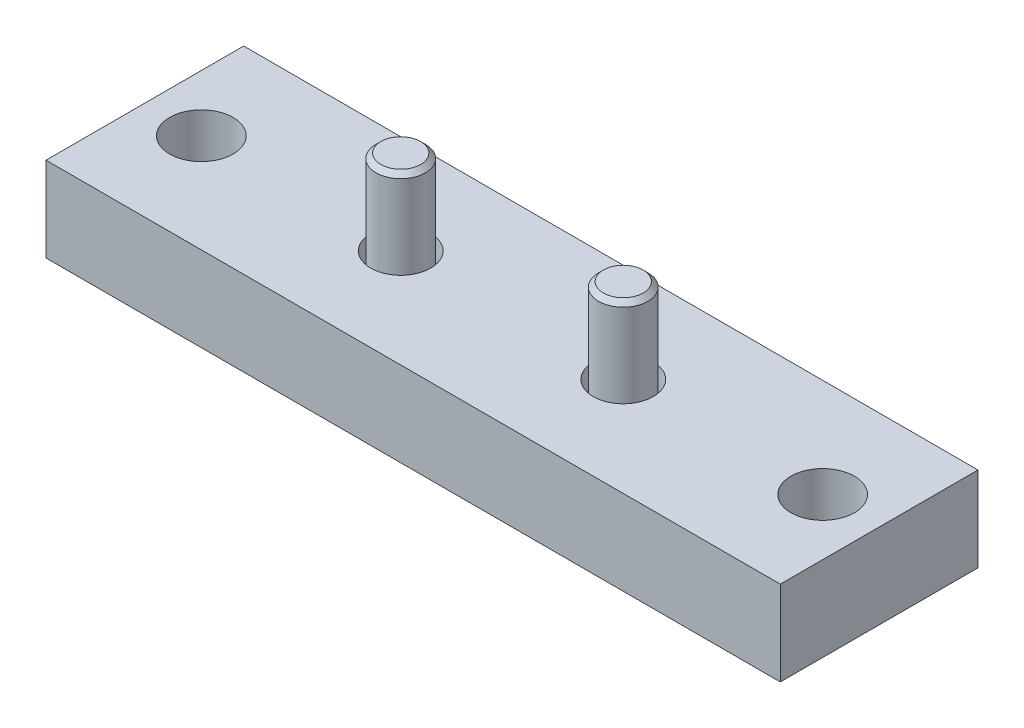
ISO-10303-21;
HEADER;
FILE_DESCRIPTION(('STEP AP214'),'2;1');
FILE_NAME('part.step','',(''),(''),'','','');
FILE_SCHEMA(('AUTOMOTIVE_DESIGN { 1 0 10303 214 1 1 1 1 }'));
ENDSEC;
DATA;
#1=APPLICATION_CONTEXT('core data for automotive mechanical design processes');
#2=APPLICATION_PROTOCOL_DEFINITION('international standard','automotive_design',2000,#1);
#3=PRODUCT_CONTEXT('',#1,'mechanical');
#4=PRODUCT('Part','Part','',(#3));
#5=PRODUCT_RELATED_PRODUCT_CATEGORY('part','',(#4));
#6=PRODUCT_DEFINITION_FORMATION('','',#4);
#7=PRODUCT_DEFINITION_CONTEXT('part definition',#1,'design');
#8=PRODUCT_DEFINITION('design','',#6,#7);
#9=PRODUCT_DEFINITION_SHAPE('','',#8);
#10=(LENGTH_UNIT() NAMED_UNIT(*) SI_UNIT(.MILLI.,.METRE.));
#11=(NAMED_UNIT(*) PLANE_ANGLE_UNIT() SI_UNIT($,.RADIAN.));
#12=(NAMED_UNIT(*) SI_UNIT($,.STERADIAN.) SOLID_ANGLE_UNIT());
#13=UNCERTAINTY_MEASURE_WITH_UNIT(LENGTH_MEASURE(1.E-05),#10,'distance_accuracy_value','');
#14=(GEOMETRIC_REPRESENTATION_CONTEXT(3) GLOBAL_UNCERTAINTY_ASSIGNED_CONTEXT((#13)) GLOBAL_UNIT_ASSIGNED_CONTEXT((#10,
#11,#12)) REPRESENTATION_CONTEXT('',''));
#15=CARTESIAN_POINT('',(0.,0.,0.));
#16=DIRECTION('',(0.,0.,1.));
#17=DIRECTION('',(1.,0.,0.));
#18=AXIS2_PLACEMENT_3D('',#15,#16,#17);
#19=CARTESIAN_POINT('',(25.019,-19.05,0.));
#20=DIRECTION('',(0.,-1.,0.));
#21=DIRECTION('',(0.,0.,1.));
#22=AXIS2_PLACEMENT_3D('',#19,#20,#21);
#23=PLANE('',#22);
#24=CARTESIAN_POINT('',(25.019,-19.05,0.));
#25=DIRECTION('',(0.,-1.,0.));
#26=DIRECTION('',(0.,0.,1.));
#27=AXIS2_PLACEMENT_3D('',#24,#25,#26);
#28=CIRCLE('',#27,10.7188);
#29=CARTESIAN_POINT('',(25.019,-19.05,10.7188));
#30=VERTEX_POINT('',#29);
#31=EDGE_CURVE('P0_E10',#30,#30,#28,.T.);
#32=ORIENTED_EDGE('',*,*,#31,.T.);
#33=EDGE_LOOP('',(#32));
#34=FACE_BOUND('',#33,.T.);
#35=DIRECTION('',(0.5,0.,-0.866025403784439));
#36=VECTOR('',#35,1.);
#37=CARTESIAN_POINT('',(26.8520871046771,-19.05,3.175));
#38=LINE('',#37,#36);
#39=CARTESIAN_POINT('',(26.8520871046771,-19.05,3.175));
#40=VERTEX_POINT('',#39);
#41=CARTESIAN_POINT('',(28.6851742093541,-19.05,0.));
#42=VERTEX_POINT('',#41);
#43=EDGE_CURVE('P0_E107',#40,#42,#38,.T.);
#44=ORIENTED_EDGE('',*,*,#43,.T.);
#45=DIRECTION('',(-0.5,0.,-0.866025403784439));
#46=VECTOR('',#45,1.);
#47=CARTESIAN_POINT('',(28.6851742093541,-19.05,0.));
#48=LINE('',#47,#46);
#49=CARTESIAN_POINT('',(26.8520871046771,-19.05,-3.175));
#50=VERTEX_POINT('',#49);
#51=EDGE_CURVE('P0_E29',#42,#50,#48,.T.);
#52=ORIENTED_EDGE('',*,*,#51,.T.);
#53=DIRECTION('',(-1.,0.,0.));
#54=VECTOR('',#53,1.);
#55=CARTESIAN_POINT('',(26.8520871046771,-19.05,-3.175));
#56=LINE('',#55,#54);
#57=CARTESIAN_POINT('',(23.185912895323,-19.05,-3.175));
#58=VERTEX_POINT('',#57);
#59=EDGE_CURVE('P0_E90',#50,#58,#56,.T.);
#60=ORIENTED_EDGE('',*,*,#59,.T.);
#61=DIRECTION('',(-0.5,0.,0.866025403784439));
#62=VECTOR('',#61,1.);
#63=CARTESIAN_POINT('',(23.185912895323,-19.05,-3.175));
#64=LINE('',#63,#62);
#65=CARTESIAN_POINT('',(21.3528257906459,-19.05,0.));
#66=VERTEX_POINT('',#65);
#67=EDGE_CURVE('P0_E97',#58,#66,#64,.T.);
#68=ORIENTED_EDGE('',*,*,#67,.T.);
#69=DIRECTION('',(0.5,0.,0.866025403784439));
#70=VECTOR('',#69,1.);
#71=CARTESIAN_POINT('',(21.3528257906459,-19.05,0.));
#72=LINE('',#71,#70);
#73=CARTESIAN_POINT('',(23.185912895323,-19.05,3.175));
#74=VERTEX_POINT('',#73);
#75=EDGE_CURVE('P0_E111',#66,#74,#72,.T.);
#76=ORIENTED_EDGE('',*,*,#75,.T.);
#77=DIRECTION('',(1.,0.,0.));
#78=VECTOR('',#77,1.);
#79=CARTESIAN_POINT('',(23.185912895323,-19.05,3.175));
#80=LINE('',#79,#78);
#81=EDGE_CURVE('P0_E114',#74,#40,#80,.T.);
#82=ORIENTED_EDGE('',*,*,#81,.T.);
#83=EDGE_LOOP('',(#44,#52,#60,#68,#76,#82));
#84=FACE_BOUND('',#83,.T.);
#85=ADVANCED_FACE('P0_F15',(#34,#84),#23,.T.);
#86=CARTESIAN_POINT('',(25.019,-19.05,0.));
#87=DIRECTION('',(0.,-1.,0.));
#88=DIRECTION('',(0.,0.,1.));
#89=AXIS2_PLACEMENT_3D('',#86,#87,#88);
#90=CYLINDRICAL_SURFACE('',#89,10.7188);
#91=CARTESIAN_POINT('',(25.019,-18.923,0.));
#92=DIRECTION('',(0.,-1.,0.));
#93=DIRECTION('',(0.,0.,1.));
#94=AXIS2_PLACEMENT_3D('',#91,#92,#93);
#95=CIRCLE('',#94,10.7188);
#96=CARTESIAN_POINT('',(25.019,-18.923,10.7188));
#97=VERTEX_POINT('',#96);
#98=EDGE_CURVE('P0_E22',#97,#97,#95,.T.);
#99=ORIENTED_EDGE('',*,*,#98,.T.);
#100=EDGE_LOOP('',(#99));
#101=FACE_BOUND('',#100,.T.);
#102=ORIENTED_EDGE('',*,*,#31,.F.);
#103=EDGE_LOOP('',(#102));
#104=FACE_BOUND('',#103,.T.);
#105=ADVANCED_FACE('P0_F164',(#101,#104),#90,.T.);
#106=CARTESIAN_POINT('',(25.019,-18.923,0.));
#107=DIRECTION('',(0.,-1.,0.));
#108=DIRECTION('',(0.,0.,1.));
#109=AXIS2_PLACEMENT_3D('',#106,#107,#108);
#110=CONICAL_SURFACE('',#109,10.7188,0.715584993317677);
#111=CARTESIAN_POINT('',(25.019,-12.9841655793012,0.));
#112=DIRECTION('',(0.,-1.,0.));
#113=DIRECTION('',(0.,0.,1.));
#114=AXIS2_PLACEMENT_3D('',#111,#112,#113);
#115=CIRCLE('',#114,5.55625);
#116=CARTESIAN_POINT('',(25.019,-12.9841655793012,5.55625));
#117=VERTEX_POINT('',#116);
#118=EDGE_CURVE('P0_E159',#117,#117,#115,.T.);
#119=ORIENTED_EDGE('',*,*,#118,.T.);
#120=EDGE_LOOP('',(#119));
#121=FACE_BOUND('',#120,.T.);
#122=ORIENTED_EDGE('',*,*,#98,.F.);
#123=EDGE_LOOP('',(#122));
#124=FACE_BOUND('',#123,.T.);
#125=ADVANCED_FACE('P0_F167',(#121,#124),#110,.T.);
#126=CARTESIAN_POINT('',(25.019,-19.05,0.));
#127=DIRECTION('',(0.,-1.,0.));
#128=DIRECTION('',(0.,0.,1.));
#129=AXIS2_PLACEMENT_3D('',#126,#127,#128);
#130=CYLINDRICAL_SURFACE('',#129,5.55625);
#131=CARTESIAN_POINT('',(25.019,17.9705,0.));
#132=DIRECTION('',(0.,-1.,0.));
#133=DIRECTION('',(0.,0.,1.));
#134=AXIS2_PLACEMENT_3D('',#131,#132,#133);
#135=CIRCLE('',#134,5.55625);
#136=CARTESIAN_POINT('',(25.019,17.9705,5.55625));
#137=VERTEX_POINT('',#136);
#138=EDGE_CURVE('P0_E156',#137,#137,#135,.T.);
#139=ORIENTED_EDGE('',*,*,#138,.T.);
#140=EDGE_LOOP('',(#139));
#141=FACE_BOUND('',#140,.T.);
#142=ORIENTED_EDGE('',*,*,#118,.F.);
#143=EDGE_LOOP('',(#142));
#144=FACE_BOUND('',#143,.T.);
#145=ADVANCED_FACE('P0_F169',(#141,#144),#130,.T.);
#146=CARTESIAN_POINT('',(25.019,19.05,0.));
#147=DIRECTION('',(0.,-1.,0.));
#148=DIRECTION('',(0.,0.,1.));
#149=AXIS2_PLACEMENT_3D('',#146,#147,#148);
#150=CONICAL_SURFACE('',#149,4.47675,0.785398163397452);
#151=ORIENTED_EDGE('',*,*,#138,.F.);
#152=EDGE_LOOP('',(#151));
#153=FACE_BOUND('',#152,.T.);
#154=CARTESIAN_POINT('',(25.019,19.05,0.));
#155=DIRECTION('',(0.,-1.,0.));
#156=DIRECTION('',(0.,0.,1.));
#157=AXIS2_PLACEMENT_3D('',#154,#155,#156);
#158=CIRCLE('',#157,4.47675);
#159=CARTESIAN_POINT('',(25.019,19.05,4.47675));
#160=VERTEX_POINT('',#159);
#161=EDGE_CURVE('P0_E152',#160,#160,#158,.T.);
#162=ORIENTED_EDGE('',*,*,#161,.T.);
#163=EDGE_LOOP('',(#162));
#164=FACE_BOUND('',#163,.T.);
#165=ADVANCED_FACE('P0_F177',(#153,#164),#150,.T.);
#166=CARTESIAN_POINT('',(20.54225,19.05,0.));
#167=DIRECTION('',(0.,1.,0.));
#168=DIRECTION('',(0.,0.,-1.));
#169=AXIS2_PLACEMENT_3D('',#166,#167,#168);
#170=PLANE('',#169);
#171=ORIENTED_EDGE('',*,*,#161,.F.);
#172=EDGE_LOOP('',(#171));
#173=FACE_BOUND('',#172,.T.);
#174=ADVANCED_FACE('P0_F216',(#173),#170,.T.);
#175=CARTESIAN_POINT('',(28.6851742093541,-15.0114,0.));
#176=DIRECTION('',(-0.866025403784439,0.,0.5));
#177=DIRECTION('',(0.5,0.,0.866025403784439));
#178=AXIS2_PLACEMENT_3D('',#175,#176,#177);
#179=PLANE('',#178);
#180=ORIENTED_EDGE('',*,*,#51,.F.);
#181=DIRECTION('',(0.,-1.,0.));
#182=VECTOR('',#181,1.);
#183=CARTESIAN_POINT('',(28.6851742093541,-15.0114,0.));
#184=LINE('',#183,#182);
#185=CARTESIAN_POINT('',(28.6851742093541,-15.0114,0.));
#186=VERTEX_POINT('',#185);
#187=EDGE_CURVE('P0_E137',#186,#42,#184,.T.);
#188=ORIENTED_EDGE('',*,*,#187,.F.);
#189=DIRECTION('',(-0.5,0.,-0.866025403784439));
#190=VECTOR('',#189,1.);
#191=CARTESIAN_POINT('',(28.6851742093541,-15.0114,0.));
#192=LINE('',#191,#190);
#193=CARTESIAN_POINT('',(27.7686306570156,-15.0114,-1.5875));
#194=VERTEX_POINT('',#193);
#195=EDGE_CURVE('P0_E117',#186,#194,#192,.T.);
#196=ORIENTED_EDGE('',*,*,#195,.T.);
#197=CARTESIAN_POINT('',(26.8520871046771,-15.0114,-3.175));
#198=VERTEX_POINT('',#197);
#199=EDGE_CURVE('P0_E102',#194,#198,#192,.T.);
#200=ORIENTED_EDGE('',*,*,#199,.T.);
#201=DIRECTION('',(0.,-1.,0.));
#202=VECTOR('',#201,1.);
#203=CARTESIAN_POINT('',(26.8520871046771,-15.0114,-3.175));
#204=LINE('',#203,#202);
#205=EDGE_CURVE('P0_E92',#198,#50,#204,.T.);
#206=ORIENTED_EDGE('',*,*,#205,.T.);
#207=EDGE_LOOP('',(#180,#188,#196,#200,#206));
#208=FACE_BOUND('',#207,.T.);
#209=ADVANCED_FACE('P0_F99',(#208),#179,.T.);
#210=CARTESIAN_POINT('',(26.8520871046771,-15.0114,-3.175));
#211=DIRECTION('',(0.,0.,1.));
#212=DIRECTION('',(0.,1.,0.));
#213=AXIS2_PLACEMENT_3D('',#210,#211,#212);
#214=PLANE('',#213);
#215=ORIENTED_EDGE('',*,*,#59,.F.);
#216=ORIENTED_EDGE('',*,*,#205,.F.);
#217=DIRECTION('',(-1.,0.,0.));
#218=VECTOR('',#217,1.);
#219=CARTESIAN_POINT('',(26.8520871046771,-15.0114,-3.175));
#220=LINE('',#219,#218);
#221=CARTESIAN_POINT('',(25.019,-15.0114,-3.175));
#222=VERTEX_POINT('',#221);
#223=EDGE_CURVE('P0_E37',#198,#222,#220,.T.);
#224=ORIENTED_EDGE('',*,*,#223,.T.);
#225=CARTESIAN_POINT('',(23.185912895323,-15.0114,-3.175));
#226=VERTEX_POINT('',#225);
#227=EDGE_CURVE('P0_E119',#222,#226,#220,.T.);
#228=ORIENTED_EDGE('',*,*,#227,.T.);
#229=DIRECTION('',(0.,-1.,0.));
#230=VECTOR('',#229,1.);
#231=CARTESIAN_POINT('',(23.185912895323,-15.0114,-3.175));
#232=LINE('',#231,#230);
#233=EDGE_CURVE('P0_E94',#226,#58,#232,.T.);
#234=ORIENTED_EDGE('',*,*,#233,.T.);
#235=EDGE_LOOP('',(#215,#216,#224,#228,#234));
#236=FACE_BOUND('',#235,.T.);
#237=ADVANCED_FACE('P0_F91',(#236),#214,.T.);
#238=CARTESIAN_POINT('',(23.185912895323,-15.0114,-3.175));
#239=DIRECTION('',(0.866025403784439,0.,0.5));
#240=DIRECTION('',(0.5,0.,-0.866025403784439));
#241=AXIS2_PLACEMENT_3D('',#238,#239,#240);
#242=PLANE('',#241);
#243=ORIENTED_EDGE('',*,*,#67,.F.);
#244=ORIENTED_EDGE('',*,*,#233,.F.);
#245=DIRECTION('',(-0.5,0.,0.866025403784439));
#246=VECTOR('',#245,1.);
#247=CARTESIAN_POINT('',(23.185912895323,-15.0114,-3.175));
#248=LINE('',#247,#246);
#249=CARTESIAN_POINT('',(22.2693693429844,-15.0114,-1.5875));
#250=VERTEX_POINT('',#249);
#251=EDGE_CURVE('P0_E122',#226,#250,#248,.T.);
#252=ORIENTED_EDGE('',*,*,#251,.T.);
#253=CARTESIAN_POINT('',(21.3528257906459,-15.0114,0.));
#254=VERTEX_POINT('',#253);
#255=EDGE_CURVE('P0_E121',#250,#254,#248,.T.);
#256=ORIENTED_EDGE('',*,*,#255,.T.);
#257=DIRECTION('',(0.,-1.,0.));
#258=VECTOR('',#257,1.);
#259=CARTESIAN_POINT('',(21.3528257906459,-15.0114,0.));
#260=LINE('',#259,#258);
#261=EDGE_CURVE('P0_E145',#254,#66,#260,.T.);
#262=ORIENTED_EDGE('',*,*,#261,.T.);
#263=EDGE_LOOP('',(#243,#244,#252,#256,#262));
#264=FACE_BOUND('',#263,.T.);
#265=ADVANCED_FACE('P0_F246',(#264),#242,.T.);
#266=CARTESIAN_POINT('',(21.3528257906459,-15.0114,0.));
#267=DIRECTION('',(0.866025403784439,0.,-0.5));
#268=DIRECTION('',(-0.5,0.,-0.866025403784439));
#269=AXIS2_PLACEMENT_3D('',#266,#267,#268);
#270=PLANE('',#269);
#271=ORIENTED_EDGE('',*,*,#75,.F.);
#272=ORIENTED_EDGE('',*,*,#261,.F.);
#273=DIRECTION('',(0.5,0.,0.866025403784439));
#274=VECTOR('',#273,1.);
#275=CARTESIAN_POINT('',(21.3528257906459,-15.0114,0.));
#276=LINE('',#275,#274);
#277=CARTESIAN_POINT('',(22.2693693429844,-15.0114,1.5875));
#278=VERTEX_POINT('',#277);
#279=EDGE_CURVE('P0_E126',#254,#278,#276,.T.);
#280=ORIENTED_EDGE('',*,*,#279,.T.);
#281=CARTESIAN_POINT('',(23.185912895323,-15.0114,3.175));
#282=VERTEX_POINT('',#281);
#283=EDGE_CURVE('P0_E125',#278,#282,#276,.T.);
#284=ORIENTED_EDGE('',*,*,#283,.T.);
#285=DIRECTION('',(0.,-1.,0.));
#286=VECTOR('',#285,1.);
#287=CARTESIAN_POINT('',(23.185912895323,-15.0114,3.175));
#288=LINE('',#287,#286);
#289=EDGE_CURVE('P0_E142',#282,#74,#288,.T.);
#290=ORIENTED_EDGE('',*,*,#289,.T.);
#291=EDGE_LOOP('',(#271,#272,#280,#284,#290));
#292=FACE_BOUND('',#291,.T.);
#293=ADVANCED_FACE('P0_F256',(#292),#270,.T.);
#294=CARTESIAN_POINT('',(23.185912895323,-15.0114,3.175));
#295=DIRECTION('',(0.,0.,-1.));
#296=DIRECTION('',(-1.,0.,0.));
#297=AXIS2_PLACEMENT_3D('',#294,#295,#296);
#298=PLANE('',#297);
#299=ORIENTED_EDGE('',*,*,#81,.F.);
#300=ORIENTED_EDGE('',*,*,#289,.F.);
#301=DIRECTION('',(1.,0.,0.));
#302=VECTOR('',#301,1.);
#303=CARTESIAN_POINT('',(23.185912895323,-15.0114,3.175));
#304=LINE('',#303,#302);
#305=CARTESIAN_POINT('',(25.019,-15.0114,3.175));
#306=VERTEX_POINT('',#305);
#307=EDGE_CURVE('P0_E130',#282,#306,#304,.T.);
#308=ORIENTED_EDGE('',*,*,#307,.T.);
#309=CARTESIAN_POINT('',(26.8520871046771,-15.0114,3.175));
#310=VERTEX_POINT('',#309);
#311=EDGE_CURVE('P0_E129',#306,#310,#304,.T.);
#312=ORIENTED_EDGE('',*,*,#311,.T.);
#313=DIRECTION('',(0.,-1.,0.));
#314=VECTOR('',#313,1.);
#315=CARTESIAN_POINT('',(26.8520871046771,-15.0114,3.175));
#316=LINE('',#315,#314);
#317=EDGE_CURVE('P0_E139',#310,#40,#316,.T.);
#318=ORIENTED_EDGE('',*,*,#317,.T.);
#319=EDGE_LOOP('',(#299,#300,#308,#312,#318));
#320=FACE_BOUND('',#319,.T.);
#321=ADVANCED_FACE('P0_F267',(#320),#298,.T.);
#322=CARTESIAN_POINT('',(26.8520871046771,-15.0114,3.175));
#323=DIRECTION('',(-0.866025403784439,0.,-0.5));
#324=DIRECTION('',(-0.5,0.,0.866025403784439));
#325=AXIS2_PLACEMENT_3D('',#322,#323,#324);
#326=PLANE('',#325);
#327=ORIENTED_EDGE('',*,*,#43,.F.);
#328=ORIENTED_EDGE('',*,*,#317,.F.);
#329=DIRECTION('',(0.5,0.,-0.866025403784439));
#330=VECTOR('',#329,1.);
#331=CARTESIAN_POINT('',(26.8520871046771,-15.0114,3.175));
#332=LINE('',#331,#330);
#333=CARTESIAN_POINT('',(27.7686306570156,-15.0114,1.5875));
#334=VERTEX_POINT('',#333);
#335=EDGE_CURVE('P0_E134',#310,#334,#332,.T.);
#336=ORIENTED_EDGE('',*,*,#335,.T.);
#337=EDGE_CURVE('P0_E133',#334,#186,#332,.T.);
#338=ORIENTED_EDGE('',*,*,#337,.T.);
#339=ORIENTED_EDGE('',*,*,#187,.T.);
#340=EDGE_LOOP('',(#327,#328,#336,#338,#339));
#341=FACE_BOUND('',#340,.T.);
#342=ADVANCED_FACE('P0_F278',(#341),#326,.T.);
#343=CARTESIAN_POINT('',(26.8520871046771,-15.0114,-3.175));
#344=DIRECTION('',(0.,1.,0.));
#345=DIRECTION('',(0.,0.,-1.));
#346=AXIS2_PLACEMENT_3D('',#343,#344,#345);
#347=PLANE('',#346);
#348=ORIENTED_EDGE('',*,*,#223,.F.);
#349=ORIENTED_EDGE('',*,*,#199,.F.);
#350=CARTESIAN_POINT('',(25.019,-15.0114,0.));
#351=DIRECTION('',(0.,-1.,0.));
#352=DIRECTION('',(0.,0.,1.));
#353=AXIS2_PLACEMENT_3D('',#350,#351,#352);
#354=CIRCLE('',#353,3.175);
#355=EDGE_CURVE('P0_E410',#222,#194,#354,.T.);
#356=ORIENTED_EDGE('',*,*,#355,.F.);
#357=EDGE_LOOP('',(#348,#349,#356));
#358=FACE_BOUND('',#357,.T.);
#359=ADVANCED_FACE('P0_F289',(#358),#347,.F.);
#360=ORIENTED_EDGE('',*,*,#195,.F.);
#361=ORIENTED_EDGE('',*,*,#337,.F.);
#362=EDGE_CURVE('P0_E412',#194,#334,#354,.T.);
#363=ORIENTED_EDGE('',*,*,#362,.F.);
#364=EDGE_LOOP('',(#360,#361,#363));
#365=FACE_BOUND('',#364,.T.);
#366=ADVANCED_FACE('P0_F300',(#365),#347,.F.);
#367=ORIENTED_EDGE('',*,*,#335,.F.);
#368=ORIENTED_EDGE('',*,*,#311,.F.);
#369=EDGE_CURVE('P0_E103',#334,#306,#354,.T.);
#370=ORIENTED_EDGE('',*,*,#369,.F.);
#371=EDGE_LOOP('',(#367,#368,#370));
#372=FACE_BOUND('',#371,.T.);
#373=ADVANCED_FACE('P0_F312',(#372),#347,.F.);
#374=ORIENTED_EDGE('',*,*,#307,.F.);
#375=ORIENTED_EDGE('',*,*,#283,.F.);
#376=EDGE_CURVE('P0_E149',#306,#278,#354,.T.);
#377=ORIENTED_EDGE('',*,*,#376,.F.);
#378=EDGE_LOOP('',(#374,#375,#377));
#379=FACE_BOUND('',#378,.T.);
#380=ADVANCED_FACE('P0_F322',(#379),#347,.F.);
#381=ORIENTED_EDGE('',*,*,#279,.F.);
#382=ORIENTED_EDGE('',*,*,#255,.F.);
#383=EDGE_CURVE('P0_E153',#278,#250,#354,.T.);
#384=ORIENTED_EDGE('',*,*,#383,.F.);
#385=EDGE_LOOP('',(#381,#382,#384));
#386=FACE_BOUND('',#385,.T.);
#387=ADVANCED_FACE('P0_F332',(#386),#347,.F.);
#388=ORIENTED_EDGE('',*,*,#251,.F.);
#389=ORIENTED_EDGE('',*,*,#227,.F.);
#390=EDGE_CURVE('P0_E409',#250,#222,#354,.T.);
#391=ORIENTED_EDGE('',*,*,#390,.F.);
#392=EDGE_LOOP('',(#388,#389,#391));
#393=FACE_BOUND('',#392,.T.);
#394=ADVANCED_FACE('P0_F303',(#393),#347,.F.);
#395=CARTESIAN_POINT('',(25.019,-15.0114,0.));
#396=DIRECTION('',(0.,-1.,0.));
#397=DIRECTION('',(0.,0.,1.));
#398=AXIS2_PLACEMENT_3D('',#395,#396,#397);
#399=CONICAL_SURFACE('',#398,3.175,1.0471975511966);
#400=CARTESIAN_POINT('',(25.019,-13.1783128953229,0.));
#401=VERTEX_POINT('',#400);
#402=VERTEX_LOOP('',#401);
#403=FACE_BOUND('',#402,.T.);
#404=ORIENTED_EDGE('',*,*,#376,.T.);
#405=ORIENTED_EDGE('',*,*,#383,.T.);
#406=ORIENTED_EDGE('',*,*,#390,.T.);
#407=ORIENTED_EDGE('',*,*,#355,.T.);
#408=ORIENTED_EDGE('',*,*,#362,.T.);
#409=ORIENTED_EDGE('',*,*,#369,.T.);
#410=EDGE_LOOP('',(#404,#405,#406,#407,#408,#409));
#411=FACE_BOUND('',#410,.T.);
#412=ADVANCED_FACE('P0_F351',(#403,#411),#399,.F.);
#413=CLOSED_SHELL('',(#85,#105,#125,#145,#165,#174,#209,#237,#265,#293,#321,#342,#359,#366,#373,
#380,#387,#394,#412));
#414=MANIFOLD_SOLID_BREP('P0_B1',#413);
#415=CARTESIAN_POINT('',(-25.019,-19.05,0.));
#416=DIRECTION('',(0.,-1.,0.));
#417=DIRECTION('',(0.,0.,1.));
#418=AXIS2_PLACEMENT_3D('',#415,#416,#417);
#419=PLANE('',#418);
#420=CARTESIAN_POINT('',(-25.019,-19.05,0.));
#421=DIRECTION('',(0.,-1.,0.));
#422=DIRECTION('',(0.,0.,1.));
#423=AXIS2_PLACEMENT_3D('',#420,#421,#422);
#424=CIRCLE('',#423,10.7188);
#425=CARTESIAN_POINT('',(-25.019,-19.05,10.7188));
#426=VERTEX_POINT('',#425);
#427=EDGE_CURVE('P1_E414',#426,#426,#424,.T.);
#428=ORIENTED_EDGE('',*,*,#427,.T.);
#429=EDGE_LOOP('',(#428));
#430=FACE_BOUND('',#429,.T.);
#431=DIRECTION('',(0.5,0.,-0.866025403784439));
#432=VECTOR('',#431,1.);
#433=CARTESIAN_POINT('',(-23.185912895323,-19.05,3.175));
#434=LINE('',#433,#432);
#435=CARTESIAN_POINT('',(-23.185912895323,-19.05,3.175));
#436=VERTEX_POINT('',#435);
#437=CARTESIAN_POINT('',(-21.3528257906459,-19.05,0.));
#438=VERTEX_POINT('',#437);
#439=EDGE_CURVE('P1_E102',#436,#438,#434,.T.);
#440=ORIENTED_EDGE('',*,*,#439,.T.);
#441=DIRECTION('',(-0.5,0.,-0.866025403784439));
#442=VECTOR('',#441,1.);
#443=CARTESIAN_POINT('',(-21.3528257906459,-19.05,0.));
#444=LINE('',#443,#442);
#445=CARTESIAN_POINT('',(-23.185912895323,-19.05,-3.175));
#446=VERTEX_POINT('',#445);
#447=EDGE_CURVE('P1_E11',#438,#446,#444,.T.);
#448=ORIENTED_EDGE('',*,*,#447,.T.);
#449=DIRECTION('',(-1.,0.,0.));
#450=VECTOR('',#449,1.);
#451=CARTESIAN_POINT('',(-23.185912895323,-19.05,-3.175));
#452=LINE('',#451,#450);
#453=CARTESIAN_POINT('',(-26.8520871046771,-19.05,-3.175));
#454=VERTEX_POINT('',#453);
#455=EDGE_CURVE('P1_E24',#446,#454,#452,.T.);
#456=ORIENTED_EDGE('',*,*,#455,.T.);
#457=DIRECTION('',(-0.5,0.,0.866025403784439));
#458=VECTOR('',#457,1.);
#459=CARTESIAN_POINT('',(-26.8520871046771,-19.05,-3.175));
#460=LINE('',#459,#458);
#461=CARTESIAN_POINT('',(-28.6851742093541,-19.05,0.));
#462=VERTEX_POINT('',#461);
#463=EDGE_CURVE('P1_E38',#454,#462,#460,.T.);
#464=ORIENTED_EDGE('',*,*,#463,.T.);
#465=DIRECTION('',(0.5,0.,0.866025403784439));
#466=VECTOR('',#465,1.);
#467=CARTESIAN_POINT('',(-28.6851742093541,-19.05,0.));
#468=LINE('',#467,#466);
#469=CARTESIAN_POINT('',(-26.8520871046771,-19.05,3.175));
#470=VERTEX_POINT('',#469);
#471=EDGE_CURVE('P1_E115',#462,#470,#468,.T.);
#472=ORIENTED_EDGE('',*,*,#471,.T.);
#473=DIRECTION('',(1.,0.,0.));
#474=VECTOR('',#473,1.);
#475=CARTESIAN_POINT('',(-26.8520871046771,-19.05,3.175));
#476=LINE('',#475,#474);
#477=EDGE_CURVE('P1_E112',#470,#436,#476,.T.);
#478=ORIENTED_EDGE('',*,*,#477,.T.);
#479=EDGE_LOOP('',(#440,#448,#456,#464,#472,#478));
#480=FACE_BOUND('',#479,.T.);
#481=ADVANCED_FACE('P1_F16',(#430,#480),#419,.T.);
#482=CARTESIAN_POINT('',(-25.019,-19.05,0.));
#483=DIRECTION('',(0.,-1.,0.));
#484=DIRECTION('',(0.,0.,1.));
#485=AXIS2_PLACEMENT_3D('',#482,#483,#484);
#486=CYLINDRICAL_SURFACE('',#485,10.7188);
#487=CARTESIAN_POINT('',(-25.019,-18.923,0.));
#488=DIRECTION('',(0.,-1.,0.));
#489=DIRECTION('',(0.,0.,1.));
#490=AXIS2_PLACEMENT_3D('',#487,#488,#489);
#491=CIRCLE('',#490,10.7188);
#492=CARTESIAN_POINT('',(-25.019,-18.923,10.7188));
#493=VERTEX_POINT('',#492);
#494=EDGE_CURVE('P1_E409',#493,#493,#491,.T.);
#495=ORIENTED_EDGE('',*,*,#494,.T.);
#496=EDGE_LOOP('',(#495));
#497=FACE_BOUND('',#496,.T.);
#498=ORIENTED_EDGE('',*,*,#427,.F.);
#499=EDGE_LOOP('',(#498));
#500=FACE_BOUND('',#499,.T.);
#501=ADVANCED_FACE('P1_F203',(#497,#500),#486,.T.);
#502=CARTESIAN_POINT('',(-25.019,-18.923,0.));
#503=DIRECTION('',(0.,-1.,0.));
#504=DIRECTION('',(0.,0.,1.));
#505=AXIS2_PLACEMENT_3D('',#502,#503,#504);
#506=CONICAL_SURFACE('',#505,10.7188,0.715584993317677);
#507=CARTESIAN_POINT('',(-25.019,-12.9841655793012,0.));
#508=DIRECTION('',(0.,-1.,0.));
#509=DIRECTION('',(0.,0.,1.));
#510=AXIS2_PLACEMENT_3D('',#507,#508,#509);
#511=CIRCLE('',#510,5.55625);
#512=CARTESIAN_POINT('',(-25.019,-12.9841655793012,5.55625));
#513=VERTEX_POINT('',#512);
#514=EDGE_CURVE('P1_E406',#513,#513,#511,.T.);
#515=ORIENTED_EDGE('',*,*,#514,.T.);
#516=EDGE_LOOP('',(#515));
#517=FACE_BOUND('',#516,.T.);
#518=ORIENTED_EDGE('',*,*,#494,.F.);
#519=EDGE_LOOP('',(#518));
#520=FACE_BOUND('',#519,.T.);
#521=ADVANCED_FACE('P1_F209',(#517,#520),#506,.T.);
#522=CARTESIAN_POINT('',(-25.019,-19.05,0.));
#523=DIRECTION('',(0.,-1.,0.));
#524=DIRECTION('',(0.,0.,1.));
#525=AXIS2_PLACEMENT_3D('',#522,#523,#524);
#526=CYLINDRICAL_SURFACE('',#525,5.55625);
#527=CARTESIAN_POINT('',(-25.019,17.9705,0.));
#528=DIRECTION('',(0.,-1.,0.));
#529=DIRECTION('',(0.,0.,1.));
#530=AXIS2_PLACEMENT_3D('',#527,#528,#529);
#531=CIRCLE('',#530,5.55625);
#532=CARTESIAN_POINT('',(-25.019,17.9705,5.55625));
#533=VERTEX_POINT('',#532);
#534=EDGE_CURVE('P1_E404',#533,#533,#531,.T.);
#535=ORIENTED_EDGE('',*,*,#534,.T.);
#536=EDGE_LOOP('',(#535));
#537=FACE_BOUND('',#536,.T.);
#538=ORIENTED_EDGE('',*,*,#514,.F.);
#539=EDGE_LOOP('',(#538));
#540=FACE_BOUND('',#539,.T.);
#541=ADVANCED_FACE('P1_F216',(#537,#540),#526,.T.);
#542=CARTESIAN_POINT('',(-25.019,19.05,0.));
#543=DIRECTION('',(0.,-1.,0.));
#544=DIRECTION('',(0.,0.,1.));
#545=AXIS2_PLACEMENT_3D('',#542,#543,#544);
#546=CONICAL_SURFACE('',#545,4.47675,0.785398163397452);
#547=ORIENTED_EDGE('',*,*,#534,.F.);
#548=EDGE_LOOP('',(#547));
#549=FACE_BOUND('',#548,.T.);
#550=CARTESIAN_POINT('',(-25.019,19.05,0.));
#551=DIRECTION('',(0.,-1.,0.));
#552=DIRECTION('',(0.,0.,1.));
#553=AXIS2_PLACEMENT_3D('',#550,#551,#552);
#554=CIRCLE('',#553,4.47675);
#555=CARTESIAN_POINT('',(-25.019,19.05,4.47675));
#556=VERTEX_POINT('',#555);
#557=EDGE_CURVE('P1_E175',#556,#556,#554,.T.);
#558=ORIENTED_EDGE('',*,*,#557,.T.);
#559=EDGE_LOOP('',(#558));
#560=FACE_BOUND('',#559,.T.);
#561=ADVANCED_FACE('P1_F220',(#549,#560),#546,.T.);
#562=CARTESIAN_POINT('',(-29.49575,19.05,0.));
#563=DIRECTION('',(0.,1.,0.));
#564=DIRECTION('',(0.,0.,-1.));
#565=AXIS2_PLACEMENT_3D('',#562,#563,#564);
#566=PLANE('',#565);
#567=ORIENTED_EDGE('',*,*,#557,.F.);
#568=EDGE_LOOP('',(#567));
#569=FACE_BOUND('',#568,.T.);
#570=ADVANCED_FACE('P1_F224',(#569),#566,.T.);
#571=CARTESIAN_POINT('',(-21.3528257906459,-15.0114,0.));
#572=DIRECTION('',(-0.866025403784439,0.,0.5));
#573=DIRECTION('',(0.5,0.,0.866025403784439));
#574=AXIS2_PLACEMENT_3D('',#571,#572,#573);
#575=PLANE('',#574);
#576=ORIENTED_EDGE('',*,*,#447,.F.);
#577=DIRECTION('',(0.,-1.,0.));
#578=VECTOR('',#577,1.);
#579=CARTESIAN_POINT('',(-21.3528257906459,-15.0114,0.));
#580=LINE('',#579,#578);
#581=CARTESIAN_POINT('',(-21.3528257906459,-15.0114,0.));
#582=VERTEX_POINT('',#581);
#583=EDGE_CURVE('P1_E94',#582,#438,#580,.T.);
#584=ORIENTED_EDGE('',*,*,#583,.F.);
#585=DIRECTION('',(-0.5,0.,-0.866025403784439));
#586=VECTOR('',#585,1.);
#587=CARTESIAN_POINT('',(-21.3528257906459,-15.0114,0.));
#588=LINE('',#587,#586);
#589=CARTESIAN_POINT('',(-22.2693693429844,-15.0114,-1.5875));
#590=VERTEX_POINT('',#589);
#591=EDGE_CURVE('P1_E117',#582,#590,#588,.T.);
#592=ORIENTED_EDGE('',*,*,#591,.T.);
#593=CARTESIAN_POINT('',(-23.185912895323,-15.0114,-3.175));
#594=VERTEX_POINT('',#593);
#595=EDGE_CURVE('P1_E113',#590,#594,#588,.T.);
#596=ORIENTED_EDGE('',*,*,#595,.T.);
#597=DIRECTION('',(0.,-1.,0.));
#598=VECTOR('',#597,1.);
#599=CARTESIAN_POINT('',(-23.185912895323,-15.0114,-3.175));
#600=LINE('',#599,#598);
#601=EDGE_CURVE('P1_E96',#594,#446,#600,.T.);
#602=ORIENTED_EDGE('',*,*,#601,.T.);
#603=EDGE_LOOP('',(#576,#584,#592,#596,#602));
#604=FACE_BOUND('',#603,.T.);
#605=ADVANCED_FACE('P1_F92',(#604),#575,.T.);
#606=CARTESIAN_POINT('',(-23.185912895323,-15.0114,-3.175));
#607=DIRECTION('',(0.,0.,1.));
#608=DIRECTION('',(0.,1.,0.));
#609=AXIS2_PLACEMENT_3D('',#606,#607,#608);
#610=PLANE('',#609);
#611=ORIENTED_EDGE('',*,*,#455,.F.);
#612=ORIENTED_EDGE('',*,*,#601,.F.);
#613=DIRECTION('',(-1.,0.,0.));
#614=VECTOR('',#613,1.);
#615=CARTESIAN_POINT('',(-23.185912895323,-15.0114,-3.175));
#616=LINE('',#615,#614);
#617=CARTESIAN_POINT('',(-25.019,-15.0114,-3.175));
#618=VERTEX_POINT('',#617);
#619=EDGE_CURVE('P1_E151',#594,#618,#616,.T.);
#620=ORIENTED_EDGE('',*,*,#619,.T.);
#621=CARTESIAN_POINT('',(-26.8520871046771,-15.0114,-3.175));
#622=VERTEX_POINT('',#621);
#623=EDGE_CURVE('P1_E152',#618,#622,#616,.T.);
#624=ORIENTED_EDGE('',*,*,#623,.T.);
#625=DIRECTION('',(0.,-1.,0.));
#626=VECTOR('',#625,1.);
#627=CARTESIAN_POINT('',(-26.8520871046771,-15.0114,-3.175));
#628=LINE('',#627,#626);
#629=EDGE_CURVE('P1_E135',#622,#454,#628,.T.);
#630=ORIENTED_EDGE('',*,*,#629,.T.);
#631=EDGE_LOOP('',(#611,#612,#620,#624,#630));
#632=FACE_BOUND('',#631,.T.);
#633=ADVANCED_FACE('P1_F231',(#632),#610,.T.);
#634=CARTESIAN_POINT('',(-26.8520871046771,-15.0114,-3.175));
#635=DIRECTION('',(0.866025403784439,0.,0.5));
#636=DIRECTION('',(0.5,0.,-0.866025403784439));
#637=AXIS2_PLACEMENT_3D('',#634,#635,#636);
#638=PLANE('',#637);
#639=ORIENTED_EDGE('',*,*,#463,.F.);
#640=ORIENTED_EDGE('',*,*,#629,.F.);
#641=DIRECTION('',(-0.5,0.,0.866025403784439));
#642=VECTOR('',#641,1.);
#643=CARTESIAN_POINT('',(-26.8520871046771,-15.0114,-3.175));
#644=LINE('',#643,#642);
#645=CARTESIAN_POINT('',(-27.7686306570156,-15.0114,-1.5875));
#646=VERTEX_POINT('',#645);
#647=EDGE_CURVE('P1_E150',#622,#646,#644,.T.);
#648=ORIENTED_EDGE('',*,*,#647,.T.);
#649=CARTESIAN_POINT('',(-28.6851742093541,-15.0114,0.));
#650=VERTEX_POINT('',#649);
#651=EDGE_CURVE('P1_E134',#646,#650,#644,.T.);
#652=ORIENTED_EDGE('',*,*,#651,.T.);
#653=DIRECTION('',(0.,-1.,0.));
#654=VECTOR('',#653,1.);
#655=CARTESIAN_POINT('',(-28.6851742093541,-15.0114,0.));
#656=LINE('',#655,#654);
#657=EDGE_CURVE('P1_E127',#650,#462,#656,.T.);
#658=ORIENTED_EDGE('',*,*,#657,.T.);
#659=EDGE_LOOP('',(#639,#640,#648,#652,#658));
#660=FACE_BOUND('',#659,.T.);
#661=ADVANCED_FACE('P1_F131',(#660),#638,.T.);
#662=CARTESIAN_POINT('',(-28.6851742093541,-15.0114,0.));
#663=DIRECTION('',(0.866025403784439,0.,-0.5));
#664=DIRECTION('',(-0.5,0.,-0.866025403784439));
#665=AXIS2_PLACEMENT_3D('',#662,#663,#664);
#666=PLANE('',#665);
#667=ORIENTED_EDGE('',*,*,#471,.F.);
#668=ORIENTED_EDGE('',*,*,#657,.F.);
#669=DIRECTION('',(0.5,0.,0.866025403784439));
#670=VECTOR('',#669,1.);
#671=CARTESIAN_POINT('',(-28.6851742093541,-15.0114,0.));
#672=LINE('',#671,#670);
#673=CARTESIAN_POINT('',(-27.7686306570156,-15.0114,1.5875));
#674=VERTEX_POINT('',#673);
#675=EDGE_CURVE('P1_E147',#650,#674,#672,.T.);
#676=ORIENTED_EDGE('',*,*,#675,.T.);
#677=CARTESIAN_POINT('',(-26.8520871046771,-15.0114,3.175));
#678=VERTEX_POINT('',#677);
#679=EDGE_CURVE('P1_E149',#674,#678,#672,.T.);
#680=ORIENTED_EDGE('',*,*,#679,.T.);
#681=DIRECTION('',(0.,-1.,0.));
#682=VECTOR('',#681,1.);
#683=CARTESIAN_POINT('',(-26.8520871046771,-15.0114,3.175));
#684=LINE('',#683,#682);
#685=EDGE_CURVE('P1_E130',#678,#470,#684,.T.);
#686=ORIENTED_EDGE('',*,*,#685,.T.);
#687=EDGE_LOOP('',(#667,#668,#676,#680,#686));
#688=FACE_BOUND('',#687,.T.);
#689=ADVANCED_FACE('P1_F125',(#688),#666,.T.);
#690=CARTESIAN_POINT('',(-26.8520871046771,-15.0114,3.175));
#691=DIRECTION('',(0.,0.,-1.));
#692=DIRECTION('',(-1.,0.,0.));
#693=AXIS2_PLACEMENT_3D('',#690,#691,#692);
#694=PLANE('',#693);
#695=ORIENTED_EDGE('',*,*,#477,.F.);
#696=ORIENTED_EDGE('',*,*,#685,.F.);
#697=DIRECTION('',(1.,0.,0.));
#698=VECTOR('',#697,1.);
#699=CARTESIAN_POINT('',(-26.8520871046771,-15.0114,3.175));
#700=LINE('',#699,#698);
#701=CARTESIAN_POINT('',(-25.019,-15.0114,3.175));
#702=VERTEX_POINT('',#701);
#703=EDGE_CURVE('P1_E143',#678,#702,#700,.T.);
#704=ORIENTED_EDGE('',*,*,#703,.T.);
#705=CARTESIAN_POINT('',(-23.185912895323,-15.0114,3.175));
#706=VERTEX_POINT('',#705);
#707=EDGE_CURVE('P1_E146',#702,#706,#700,.T.);
#708=ORIENTED_EDGE('',*,*,#707,.T.);
#709=DIRECTION('',(0.,-1.,0.));
#710=VECTOR('',#709,1.);
#711=CARTESIAN_POINT('',(-23.185912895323,-15.0114,3.175));
#712=LINE('',#711,#710);
#713=EDGE_CURVE('P1_E108',#706,#436,#712,.T.);
#714=ORIENTED_EDGE('',*,*,#713,.T.);
#715=EDGE_LOOP('',(#695,#696,#704,#708,#714));
#716=FACE_BOUND('',#715,.T.);
#717=ADVANCED_FACE('P1_F183',(#716),#694,.T.);
#718=CARTESIAN_POINT('',(-23.185912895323,-15.0114,3.175));
#719=DIRECTION('',(-0.866025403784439,0.,-0.5));
#720=DIRECTION('',(-0.5,0.,0.866025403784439));
#721=AXIS2_PLACEMENT_3D('',#718,#719,#720);
#722=PLANE('',#721);
#723=ORIENTED_EDGE('',*,*,#439,.F.);
#724=ORIENTED_EDGE('',*,*,#713,.F.);
#725=DIRECTION('',(0.5,0.,-0.866025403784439));
#726=VECTOR('',#725,1.);
#727=CARTESIAN_POINT('',(-23.185912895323,-15.0114,3.175));
#728=LINE('',#727,#726);
#729=CARTESIAN_POINT('',(-22.2693693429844,-15.0114,1.5875));
#730=VERTEX_POINT('',#729);
#731=EDGE_CURVE('P1_E107',#706,#730,#728,.T.);
#732=ORIENTED_EDGE('',*,*,#731,.T.);
#733=EDGE_CURVE('P1_E106',#730,#582,#728,.T.);
#734=ORIENTED_EDGE('',*,*,#733,.T.);
#735=ORIENTED_EDGE('',*,*,#583,.T.);
#736=EDGE_LOOP('',(#723,#724,#732,#734,#735));
#737=FACE_BOUND('',#736,.T.);
#738=ADVANCED_FACE('P1_F100',(#737),#722,.T.);
#739=CARTESIAN_POINT('',(-23.185912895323,-15.0114,-3.175));
#740=DIRECTION('',(0.,1.,0.));
#741=DIRECTION('',(0.,0.,-1.));
#742=AXIS2_PLACEMENT_3D('',#739,#740,#741);
#743=PLANE('',#742);
#744=ORIENTED_EDGE('',*,*,#619,.F.);
#745=ORIENTED_EDGE('',*,*,#595,.F.);
#746=CARTESIAN_POINT('',(-25.019,-15.0114,0.));
#747=DIRECTION('',(0.,-1.,0.));
#748=DIRECTION('',(0.,0.,1.));
#749=AXIS2_PLACEMENT_3D('',#746,#747,#748);
#750=CIRCLE('',#749,3.175);
#751=EDGE_CURVE('P1_E162',#618,#590,#750,.T.);
#752=ORIENTED_EDGE('',*,*,#751,.F.);
#753=EDGE_LOOP('',(#744,#745,#752));
#754=FACE_BOUND('',#753,.T.);
#755=ADVANCED_FACE('P1_F18',(#754),#743,.F.);
#756=ORIENTED_EDGE('',*,*,#591,.F.);
#757=ORIENTED_EDGE('',*,*,#733,.F.);
#758=EDGE_CURVE('P1_E166',#590,#730,#750,.T.);
#759=ORIENTED_EDGE('',*,*,#758,.F.);
#760=EDGE_LOOP('',(#756,#757,#759));
#761=FACE_BOUND('',#760,.T.);
#762=ADVANCED_FACE('P1_F181',(#761),#743,.F.);
#763=ORIENTED_EDGE('',*,*,#731,.F.);
#764=ORIENTED_EDGE('',*,*,#707,.F.);
#765=EDGE_CURVE('P1_E171',#730,#702,#750,.T.);
#766=ORIENTED_EDGE('',*,*,#765,.F.);
#767=EDGE_LOOP('',(#763,#764,#766));
#768=FACE_BOUND('',#767,.T.);
#769=ADVANCED_FACE('P1_F180',(#768),#743,.F.);
#770=ORIENTED_EDGE('',*,*,#703,.F.);
#771=ORIENTED_EDGE('',*,*,#679,.F.);
#772=EDGE_CURVE('P1_E173',#702,#674,#750,.T.);
#773=ORIENTED_EDGE('',*,*,#772,.F.);
#774=EDGE_LOOP('',(#770,#771,#773));
#775=FACE_BOUND('',#774,.T.);
#776=ADVANCED_FACE('P1_F187',(#775),#743,.F.);
#777=ORIENTED_EDGE('',*,*,#675,.F.);
#778=ORIENTED_EDGE('',*,*,#651,.F.);
#779=EDGE_CURVE('P1_E172',#674,#646,#750,.T.);
#780=ORIENTED_EDGE('',*,*,#779,.F.);
#781=EDGE_LOOP('',(#777,#778,#780));
#782=FACE_BOUND('',#781,.T.);
#783=ADVANCED_FACE('P1_F189',(#782),#743,.F.);
#784=ORIENTED_EDGE('',*,*,#647,.F.);
#785=ORIENTED_EDGE('',*,*,#623,.F.);
#786=EDGE_CURVE('P1_E168',#646,#618,#750,.T.);
#787=ORIENTED_EDGE('',*,*,#786,.F.);
#788=EDGE_LOOP('',(#784,#785,#787));
#789=FACE_BOUND('',#788,.T.);
#790=ADVANCED_FACE('P1_F192',(#789),#743,.F.);
#791=CARTESIAN_POINT('',(-25.019,-15.0114,0.));
#792=DIRECTION('',(0.,-1.,0.));
#793=DIRECTION('',(0.,0.,1.));
#794=AXIS2_PLACEMENT_3D('',#791,#792,#793);
#795=CONICAL_SURFACE('',#794,3.175,1.0471975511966);
#796=CARTESIAN_POINT('',(-25.019,-13.1783128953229,0.));
#797=VERTEX_POINT('',#796);
#798=VERTEX_LOOP('',#797);
#799=FACE_BOUND('',#798,.T.);
#800=ORIENTED_EDGE('',*,*,#772,.T.);
#801=ORIENTED_EDGE('',*,*,#779,.T.);
#802=ORIENTED_EDGE('',*,*,#786,.T.);
#803=ORIENTED_EDGE('',*,*,#751,.T.);
#804=ORIENTED_EDGE('',*,*,#758,.T.);
#805=ORIENTED_EDGE('',*,*,#765,.T.);
#806=EDGE_LOOP('',(#800,#801,#802,#803,#804,#805));
#807=FACE_BOUND('',#806,.T.);
#808=ADVANCED_FACE('P1_F164',(#799,#807),#795,.F.);
#809=CLOSED_SHELL('',(#481,#501,#521,#541,#561,#570,#605,#633,#661,#689,#717,#738,#755,#762,
#769,#776,#783,#790,#808));
#810=MANIFOLD_SOLID_BREP('P1_B1',#809);
#811=CARTESIAN_POINT('',(82.55,-19.05,-22.225));
#812=DIRECTION('',(-1.,0.,0.));
#813=DIRECTION('',(0.,0.,-1.));
#814=AXIS2_PLACEMENT_3D('',#811,#812,#813);
#815=PLANE('',#814);
#816=DIRECTION('',(0.,0.,1.));
#817=VECTOR('',#816,1.);
#818=CARTESIAN_POINT('',(82.55,0.,-22.225));
#819=LINE('',#818,#817);
#820=CARTESIAN_POINT('',(82.55,0.,-22.225));
#821=VERTEX_POINT('',#820);
#822=CARTESIAN_POINT('',(82.55,0.,22.225));
#823=VERTEX_POINT('',#822);
#824=EDGE_CURVE('P2_E87',#821,#823,#819,.T.);
#825=ORIENTED_EDGE('',*,*,#824,.T.);
#826=DIRECTION('',(0.,1.,0.));
#827=VECTOR('',#826,1.);
#828=CARTESIAN_POINT('',(82.55,-19.05,22.225));
#829=LINE('',#828,#827);
#830=CARTESIAN_POINT('',(82.55,-19.05,22.225));
#831=VERTEX_POINT('',#830);
#832=EDGE_CURVE('P2_E77',#831,#823,#829,.T.);
#833=ORIENTED_EDGE('',*,*,#832,.F.);
#834=DIRECTION('',(0.,0.,1.));
#835=VECTOR('',#834,1.);
#836=CARTESIAN_POINT('',(82.55,-19.05,-22.225));
#837=LINE('',#836,#835);
#838=CARTESIAN_POINT('',(82.55,-19.05,-22.225));
#839=VERTEX_POINT('',#838);
#840=EDGE_CURVE('P2_E60',#839,#831,#837,.T.);
#841=ORIENTED_EDGE('',*,*,#840,.F.);
#842=DIRECTION('',(0.,1.,0.));
#843=VECTOR('',#842,1.);
#844=CARTESIAN_POINT('',(82.55,-19.05,-22.225));
#845=LINE('',#844,#843);
#846=EDGE_CURVE('P2_E67',#839,#821,#845,.T.);
#847=ORIENTED_EDGE('',*,*,#846,.T.);
#848=EDGE_LOOP('',(#825,#833,#841,#847));
#849=FACE_BOUND('',#848,.T.);
#850=ADVANCED_FACE('P2_F15',(#849),#815,.F.);
#851=CARTESIAN_POINT('',(82.55,-19.05,22.225));
#852=DIRECTION('',(0.,0.,-1.));
#853=DIRECTION('',(1.,0.,0.));
#854=AXIS2_PLACEMENT_3D('',#851,#852,#853);
#855=PLANE('',#854);
#856=DIRECTION('',(-1.,0.,0.));
#857=VECTOR('',#856,1.);
#858=CARTESIAN_POINT('',(82.55,0.,22.225));
#859=LINE('',#858,#857);
#860=CARTESIAN_POINT('',(-82.55,0.,22.225));
#861=VERTEX_POINT('',#860);
#862=EDGE_CURVE('P2_E30',#823,#861,#859,.T.);
#863=ORIENTED_EDGE('',*,*,#862,.T.);
#864=DIRECTION('',(0.,1.,0.));
#865=VECTOR('',#864,1.);
#866=CARTESIAN_POINT('',(-82.55,-19.05,22.225));
#867=LINE('',#866,#865);
#868=CARTESIAN_POINT('',(-82.55,-19.05,22.225));
#869=VERTEX_POINT('',#868);
#870=EDGE_CURVE('P2_E277',#869,#861,#867,.T.);
#871=ORIENTED_EDGE('',*,*,#870,.F.);
#872=DIRECTION('',(-1.,0.,0.));
#873=VECTOR('',#872,1.);
#874=CARTESIAN_POINT('',(82.55,-19.05,22.225));
#875=LINE('',#874,#873);
#876=EDGE_CURVE('P2_E78',#831,#869,#875,.T.);
#877=ORIENTED_EDGE('',*,*,#876,.F.);
#878=ORIENTED_EDGE('',*,*,#832,.T.);
#879=EDGE_LOOP('',(#863,#871,#877,#878));
#880=FACE_BOUND('',#879,.T.);
#881=ADVANCED_FACE('P2_F148',(#880),#855,.F.);
#882=CARTESIAN_POINT('',(-82.55,-19.05,-22.225));
#883=DIRECTION('',(1.,0.,0.));
#884=DIRECTION('',(0.,0.,1.));
#885=AXIS2_PLACEMENT_3D('',#882,#883,#884);
#886=PLANE('',#885);
#887=DIRECTION('',(0.,0.,-1.));
#888=VECTOR('',#887,1.);
#889=CARTESIAN_POINT('',(-82.55,0.,-22.225));
#890=LINE('',#889,#888);
#891=CARTESIAN_POINT('',(-82.55,0.,-22.225));
#892=VERTEX_POINT('',#891);
#893=EDGE_CURVE('P2_E80',#861,#892,#890,.T.);
#894=ORIENTED_EDGE('',*,*,#893,.T.);
#895=DIRECTION('',(0.,1.,0.));
#896=VECTOR('',#895,1.);
#897=CARTESIAN_POINT('',(-82.55,-19.05,-22.225));
#898=LINE('',#897,#896);
#899=CARTESIAN_POINT('',(-82.55,-19.05,-22.225));
#900=VERTEX_POINT('',#899);
#901=EDGE_CURVE('P2_E75',#900,#892,#898,.T.);
#902=ORIENTED_EDGE('',*,*,#901,.F.);
#903=DIRECTION('',(0.,0.,-1.));
#904=VECTOR('',#903,1.);
#905=CARTESIAN_POINT('',(-82.55,-19.05,-22.225));
#906=LINE('',#905,#904);
#907=EDGE_CURVE('P2_E63',#869,#900,#906,.T.);
#908=ORIENTED_EDGE('',*,*,#907,.F.);
#909=ORIENTED_EDGE('',*,*,#870,.T.);
#910=EDGE_LOOP('',(#894,#902,#908,#909));
#911=FACE_BOUND('',#910,.T.);
#912=ADVANCED_FACE('P2_F153',(#911),#886,.F.);
#913=CARTESIAN_POINT('',(82.55,-19.05,-22.225));
#914=DIRECTION('',(0.,0.,1.));
#915=DIRECTION('',(-1.,0.,0.));
#916=AXIS2_PLACEMENT_3D('',#913,#914,#915);
#917=PLANE('',#916);
#918=DIRECTION('',(1.,0.,0.));
#919=VECTOR('',#918,1.);
#920=CARTESIAN_POINT('',(82.55,0.,-22.225));
#921=LINE('',#920,#919);
#922=EDGE_CURVE('P2_E72',#892,#821,#921,.T.);
#923=ORIENTED_EDGE('',*,*,#922,.T.);
#924=ORIENTED_EDGE('',*,*,#846,.F.);
#925=DIRECTION('',(1.,0.,0.));
#926=VECTOR('',#925,1.);
#927=CARTESIAN_POINT('',(82.55,-19.05,-22.225));
#928=LINE('',#927,#926);
#929=EDGE_CURVE('P2_E56',#900,#839,#928,.T.);
#930=ORIENTED_EDGE('',*,*,#929,.F.);
#931=ORIENTED_EDGE('',*,*,#901,.T.);
#932=EDGE_LOOP('',(#923,#924,#930,#931));
#933=FACE_BOUND('',#932,.T.);
#934=ADVANCED_FACE('P2_F70',(#933),#917,.F.);
#935=CARTESIAN_POINT('',(82.55,-19.05,-22.225));
#936=DIRECTION('',(0.,-1.,0.));
#937=DIRECTION('',(0.,0.,1.));
#938=AXIS2_PLACEMENT_3D('',#935,#936,#937);
#939=PLANE('',#938);
#940=CARTESIAN_POINT('',(69.85,-19.05,0.));
#941=DIRECTION('',(0.,-1.,0.));
#942=DIRECTION('',(0.,0.,1.));
#943=AXIS2_PLACEMENT_3D('',#940,#941,#942);
#944=CIRCLE('',#943,7.1374);
#945=CARTESIAN_POINT('',(69.85,-19.05,7.1374));
#946=VERTEX_POINT('',#945);
#947=EDGE_CURVE('P2_E10',#946,#946,#944,.T.);
#948=ORIENTED_EDGE('',*,*,#947,.F.);
#949=EDGE_LOOP('',(#948));
#950=FACE_BOUND('',#949,.T.);
#951=CARTESIAN_POINT('',(-69.85,-19.05,0.));
#952=DIRECTION('',(0.,-1.,0.));
#953=DIRECTION('',(0.,0.,1.));
#954=AXIS2_PLACEMENT_3D('',#951,#952,#953);
#955=CIRCLE('',#954,7.1374);
#956=CARTESIAN_POINT('',(-69.85,-19.05,7.1374));
#957=VERTEX_POINT('',#956);
#958=EDGE_CURVE('P2_E110',#957,#957,#955,.T.);
#959=ORIENTED_EDGE('',*,*,#958,.F.);
#960=EDGE_LOOP('',(#959));
#961=FACE_BOUND('',#960,.T.);
#962=CARTESIAN_POINT('',(25.019,-19.05,0.));
#963=DIRECTION('',(0.,-1.,0.));
#964=DIRECTION('',(0.,0.,1.));
#965=AXIS2_PLACEMENT_3D('',#962,#963,#964);
#966=CIRCLE('',#965,11.9126);
#967=CARTESIAN_POINT('',(25.019,-19.05,11.9126));
#968=VERTEX_POINT('',#967);
#969=EDGE_CURVE('P2_E101',#968,#968,#966,.T.);
#970=ORIENTED_EDGE('',*,*,#969,.F.);
#971=EDGE_LOOP('',(#970));
#972=FACE_BOUND('',#971,.T.);
#973=CARTESIAN_POINT('',(-25.019,-19.05,0.));
#974=DIRECTION('',(0.,-1.,0.));
#975=DIRECTION('',(0.,0.,1.));
#976=AXIS2_PLACEMENT_3D('',#973,#974,#975);
#977=CIRCLE('',#976,11.9126);
#978=CARTESIAN_POINT('',(-25.019,-19.05,11.9126));
#979=VERTEX_POINT('',#978);
#980=EDGE_CURVE('P2_E92',#979,#979,#977,.T.);
#981=ORIENTED_EDGE('',*,*,#980,.F.);
#982=EDGE_LOOP('',(#981));
#983=FACE_BOUND('',#982,.T.);
#984=ORIENTED_EDGE('',*,*,#840,.T.);
#985=ORIENTED_EDGE('',*,*,#876,.T.);
#986=ORIENTED_EDGE('',*,*,#907,.T.);
#987=ORIENTED_EDGE('',*,*,#929,.T.);
#988=EDGE_LOOP('',(#984,#985,#986,#987));
#989=FACE_BOUND('',#988,.T.);
#990=ADVANCED_FACE('P2_F58',(#950,#961,#972,#983,#989),#939,.T.);
#991=CARTESIAN_POINT('',(82.55,0.,-22.225));
#992=DIRECTION('',(0.,-1.,0.));
#993=DIRECTION('',(0.,0.,1.));
#994=AXIS2_PLACEMENT_3D('',#991,#992,#993);
#995=PLANE('',#994);
#996=CARTESIAN_POINT('',(69.85,0.,0.));
#997=DIRECTION('',(0.,-1.,0.));
#998=DIRECTION('',(0.,0.,1.));
#999=AXIS2_PLACEMENT_3D('',#996,#997,#998);
#1000=CIRCLE('',#999,7.1374);
#1001=CARTESIAN_POINT('',(69.85,0.,7.1374));
#1002=VERTEX_POINT('',#1001);
#1003=EDGE_CURVE('P2_E23',#1002,#1002,#1000,.T.);
#1004=ORIENTED_EDGE('',*,*,#1003,.T.);
#1005=EDGE_LOOP('',(#1004));
#1006=FACE_BOUND('',#1005,.T.);
#1007=CARTESIAN_POINT('',(-69.85,0.,0.));
#1008=DIRECTION('',(0.,-1.,0.));
#1009=DIRECTION('',(0.,0.,1.));
#1010=AXIS2_PLACEMENT_3D('',#1007,#1008,#1009);
#1011=CIRCLE('',#1010,7.1374);
#1012=CARTESIAN_POINT('',(-69.85,0.,7.1374));
#1013=VERTEX_POINT('',#1012);
#1014=EDGE_CURVE('P2_E107',#1013,#1013,#1011,.T.);
#1015=ORIENTED_EDGE('',*,*,#1014,.T.);
#1016=EDGE_LOOP('',(#1015));
#1017=FACE_BOUND('',#1016,.T.);
#1018=CARTESIAN_POINT('',(25.019,0.,0.));
#1019=DIRECTION('',(0.,-1.,0.));
#1020=DIRECTION('',(0.,0.,1.));
#1021=AXIS2_PLACEMENT_3D('',#1018,#1019,#1020);
#1022=CIRCLE('',#1021,6.7437);
#1023=CARTESIAN_POINT('',(25.019,0.,6.7437));
#1024=VERTEX_POINT('',#1023);
#1025=EDGE_CURVE('P2_E98',#1024,#1024,#1022,.T.);
#1026=ORIENTED_EDGE('',*,*,#1025,.T.);
#1027=EDGE_LOOP('',(#1026));
#1028=FACE_BOUND('',#1027,.T.);
#1029=CARTESIAN_POINT('',(-25.019,0.,0.));
#1030=DIRECTION('',(0.,-1.,0.));
#1031=DIRECTION('',(0.,0.,1.));
#1032=AXIS2_PLACEMENT_3D('',#1029,#1030,#1031);
#1033=CIRCLE('',#1032,6.7437);
#1034=CARTESIAN_POINT('',(-25.019,0.,6.7437));
#1035=VERTEX_POINT('',#1034);
#1036=EDGE_CURVE('P2_E89',#1035,#1035,#1033,.T.);
#1037=ORIENTED_EDGE('',*,*,#1036,.T.);
#1038=EDGE_LOOP('',(#1037));
#1039=FACE_BOUND('',#1038,.T.);
#1040=ORIENTED_EDGE('',*,*,#824,.F.);
#1041=ORIENTED_EDGE('',*,*,#922,.F.);
#1042=ORIENTED_EDGE('',*,*,#893,.F.);
#1043=ORIENTED_EDGE('',*,*,#862,.F.);
#1044=EDGE_LOOP('',(#1040,#1041,#1042,#1043));
#1045=FACE_BOUND('',#1044,.T.);
#1046=ADVANCED_FACE('P2_F115',(#1006,#1017,#1028,#1039,#1045),#995,.F.);
#1047=CARTESIAN_POINT('',(-25.019,-19.05,0.));
#1048=DIRECTION('',(0.,-1.,0.));
#1049=DIRECTION('',(0.,0.,1.));
#1050=AXIS2_PLACEMENT_3D('',#1047,#1048,#1049);
#1051=CONICAL_SURFACE('',#1050,11.9126,0.759218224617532);
#1052=CARTESIAN_POINT('',(-25.019,-13.6031159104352,0.));
#1053=DIRECTION('',(0.,-1.,0.));
#1054=DIRECTION('',(0.,0.,1.));
#1055=AXIS2_PLACEMENT_3D('',#1052,#1053,#1054);
#1056=CIRCLE('',#1055,6.7437);
#1057=CARTESIAN_POINT('',(-25.019,-13.6031159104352,6.7437));
#1058=VERTEX_POINT('',#1057);
#1059=EDGE_CURVE('P2_E95',#1058,#1058,#1056,.T.);
#1060=ORIENTED_EDGE('',*,*,#1059,.F.);
#1061=EDGE_LOOP('',(#1060));
#1062=FACE_BOUND('',#1061,.T.);
#1063=ORIENTED_EDGE('',*,*,#980,.T.);
#1064=EDGE_LOOP('',(#1063));
#1065=FACE_BOUND('',#1064,.T.);
#1066=ADVANCED_FACE('P2_F132',(#1062,#1065),#1051,.F.);
#1067=CARTESIAN_POINT('',(-25.019,-19.05,0.));
#1068=DIRECTION('',(0.,-1.,0.));
#1069=DIRECTION('',(0.,0.,1.));
#1070=AXIS2_PLACEMENT_3D('',#1067,#1068,#1069);
#1071=CYLINDRICAL_SURFACE('',#1070,6.7437);
#1072=ORIENTED_EDGE('',*,*,#1036,.F.);
#1073=EDGE_LOOP('',(#1072));
#1074=FACE_BOUND('',#1073,.T.);
#1075=ORIENTED_EDGE('',*,*,#1059,.T.);
#1076=EDGE_LOOP('',(#1075));
#1077=FACE_BOUND('',#1076,.T.);
#1078=ADVANCED_FACE('P2_F134',(#1074,#1077),#1071,.F.);
#1079=CARTESIAN_POINT('',(25.019,-19.05,0.));
#1080=DIRECTION('',(0.,-1.,0.));
#1081=DIRECTION('',(0.,0.,1.));
#1082=AXIS2_PLACEMENT_3D('',#1079,#1080,#1081);
#1083=CONICAL_SURFACE('',#1082,11.9126,0.759218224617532);
#1084=CARTESIAN_POINT('',(25.019,-13.6031159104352,0.));
#1085=DIRECTION('',(0.,-1.,0.));
#1086=DIRECTION('',(0.,0.,1.));
#1087=AXIS2_PLACEMENT_3D('',#1084,#1085,#1086);
#1088=CIRCLE('',#1087,6.7437);
#1089=CARTESIAN_POINT('',(25.019,-13.6031159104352,6.7437));
#1090=VERTEX_POINT('',#1089);
#1091=EDGE_CURVE('P2_E104',#1090,#1090,#1088,.T.);
#1092=ORIENTED_EDGE('',*,*,#1091,.F.);
#1093=EDGE_LOOP('',(#1092));
#1094=FACE_BOUND('',#1093,.T.);
#1095=ORIENTED_EDGE('',*,*,#969,.T.);
#1096=EDGE_LOOP('',(#1095));
#1097=FACE_BOUND('',#1096,.T.);
#1098=ADVANCED_FACE('P2_F142',(#1094,#1097),#1083,.F.);
#1099=CARTESIAN_POINT('',(25.019,-19.05,0.));
#1100=DIRECTION('',(0.,-1.,0.));
#1101=DIRECTION('',(0.,0.,1.));
#1102=AXIS2_PLACEMENT_3D('',#1099,#1100,#1101);
#1103=CYLINDRICAL_SURFACE('',#1102,6.7437);
#1104=ORIENTED_EDGE('',*,*,#1025,.F.);
#1105=EDGE_LOOP('',(#1104));
#1106=FACE_BOUND('',#1105,.T.);
#1107=ORIENTED_EDGE('',*,*,#1091,.T.);
#1108=EDGE_LOOP('',(#1107));
#1109=FACE_BOUND('',#1108,.T.);
#1110=ADVANCED_FACE('P2_F199',(#1106,#1109),#1103,.F.);
#1111=CARTESIAN_POINT('',(-69.85,-19.05,0.));
#1112=DIRECTION('',(0.,-1.,0.));
#1113=DIRECTION('',(0.,0.,1.));
#1114=AXIS2_PLACEMENT_3D('',#1111,#1112,#1113);
#1115=CYLINDRICAL_SURFACE('',#1114,7.1374);
#1116=ORIENTED_EDGE('',*,*,#1014,.F.);
#1117=EDGE_LOOP('',(#1116));
#1118=FACE_BOUND('',#1117,.T.);
#1119=ORIENTED_EDGE('',*,*,#958,.T.);
#1120=EDGE_LOOP('',(#1119));
#1121=FACE_BOUND('',#1120,.T.);
#1122=ADVANCED_FACE('P2_F120',(#1118,#1121),#1115,.F.);
#1123=CARTESIAN_POINT('',(69.85,-19.05,0.));
#1124=DIRECTION('',(0.,-1.,0.));
#1125=DIRECTION('',(0.,0.,1.));
#1126=AXIS2_PLACEMENT_3D('',#1123,#1124,#1125);
#1127=CYLINDRICAL_SURFACE('',#1126,7.1374);
#1128=ORIENTED_EDGE('',*,*,#1003,.F.);
#1129=EDGE_LOOP('',(#1128));
#1130=FACE_BOUND('',#1129,.T.);
#1131=ORIENTED_EDGE('',*,*,#947,.T.);
#1132=EDGE_LOOP('',(#1131));
#1133=FACE_BOUND('',#1132,.T.);
#1134=ADVANCED_FACE('P2_F17',(#1130,#1133),#1127,.F.);
#1135=CLOSED_SHELL('',(#850,#881,#912,#934,#990,#1046,#1066,#1078,#1098,#1110,#1122,#1134));
#1136=MANIFOLD_SOLID_BREP('P2_B1',#1135);
#1137=ADVANCED_BREP_SHAPE_REPRESENTATION('',(#18,#414,#810,#1136),#14);
#1138=SHAPE_DEFINITION_REPRESENTATION(#9,#1137);
ENDSEC;
END-ISO-10303-21;
